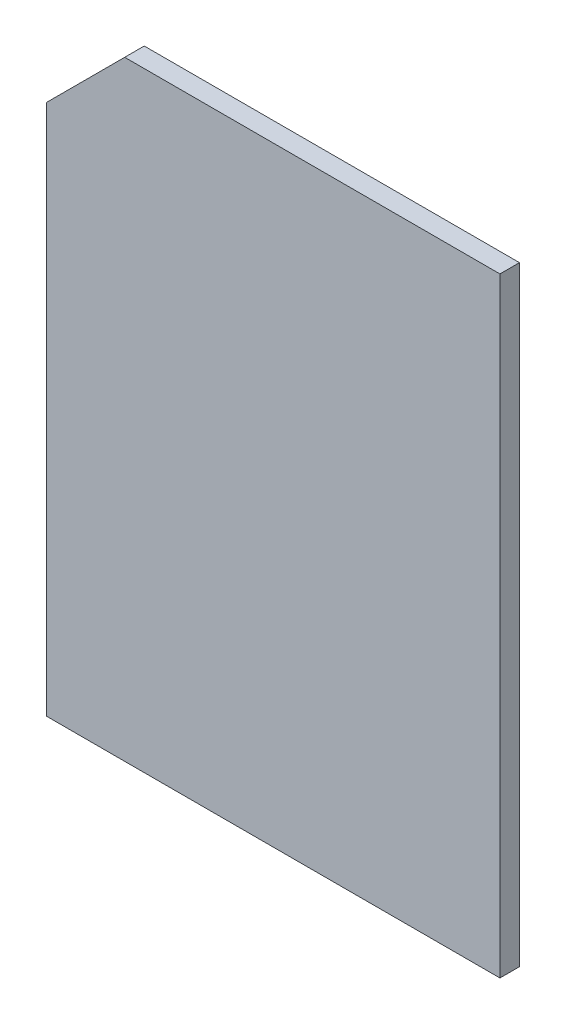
ISO-10303-21;
HEADER;
FILE_DESCRIPTION(('STEP AP214'),'2;1');
FILE_NAME('part.step','',(''),(''),'','','');
FILE_SCHEMA(('AUTOMOTIVE_DESIGN { 1 0 10303 214 1 1 1 1 }'));
ENDSEC;
DATA;
#1=APPLICATION_CONTEXT('core data for automotive mechanical design processes');
#2=APPLICATION_PROTOCOL_DEFINITION('international standard','automotive_design',2000,#1);
#3=PRODUCT_CONTEXT('',#1,'mechanical');
#4=PRODUCT('Part','Part','',(#3));
#5=PRODUCT_RELATED_PRODUCT_CATEGORY('part','',(#4));
#6=PRODUCT_DEFINITION_FORMATION('','',#4);
#7=PRODUCT_DEFINITION_CONTEXT('part definition',#1,'design');
#8=PRODUCT_DEFINITION('design','',#6,#7);
#9=PRODUCT_DEFINITION_SHAPE('','',#8);
#10=(LENGTH_UNIT() NAMED_UNIT(*) SI_UNIT(.MILLI.,.METRE.));
#11=(NAMED_UNIT(*) PLANE_ANGLE_UNIT() SI_UNIT($,.RADIAN.));
#12=(NAMED_UNIT(*) SI_UNIT($,.STERADIAN.) SOLID_ANGLE_UNIT());
#13=UNCERTAINTY_MEASURE_WITH_UNIT(LENGTH_MEASURE(1.E-05),#10,'distance_accuracy_value','');
#14=(GEOMETRIC_REPRESENTATION_CONTEXT(3) GLOBAL_UNCERTAINTY_ASSIGNED_CONTEXT((#13)) GLOBAL_UNIT_ASSIGNED_CONTEXT((#10,
#11,#12)) REPRESENTATION_CONTEXT('',''));
#15=CARTESIAN_POINT('',(0.,0.,0.));
#16=DIRECTION('',(0.,0.,1.));
#17=DIRECTION('',(1.,0.,0.));
#18=AXIS2_PLACEMENT_3D('',#15,#16,#17);
#19=CARTESIAN_POINT('',(0.,0.,1.5875));
#20=DIRECTION('',(-1.,0.,0.));
#21=DIRECTION('',(0.,0.,1.));
#22=AXIS2_PLACEMENT_3D('',#19,#20,#21);
#23=PLANE('',#22);
#24=DIRECTION('',(0.,1.,0.));
#25=VECTOR('',#24,1.);
#26=CARTESIAN_POINT('',(0.,0.,0.));
#27=LINE('',#26,#25);
#28=CARTESIAN_POINT('',(0.,0.,0.));
#29=VERTEX_POINT('',#28);
#30=CARTESIAN_POINT('',(0.,49.53,0.));
#31=VERTEX_POINT('',#30);
#32=EDGE_CURVE('E107',#29,#31,#27,.T.);
#33=ORIENTED_EDGE('',*,*,#32,.T.);
#34=DIRECTION('',(0.,0.,-1.));
#35=VECTOR('',#34,1.);
#36=CARTESIAN_POINT('',(0.,49.53,1.5875));
#37=LINE('',#36,#35);
#38=CARTESIAN_POINT('',(0.,49.53,1.5875));
#39=VERTEX_POINT('',#38);
#40=EDGE_CURVE('E11',#39,#31,#37,.T.);
#41=ORIENTED_EDGE('',*,*,#40,.F.);
#42=DIRECTION('',(0.,1.,0.));
#43=VECTOR('',#42,1.);
#44=CARTESIAN_POINT('',(0.,0.,1.5875));
#45=LINE('',#44,#43);
#46=CARTESIAN_POINT('',(0.,0.,1.5875));
#47=VERTEX_POINT('',#46);
#48=EDGE_CURVE('E115',#47,#39,#45,.T.);
#49=ORIENTED_EDGE('',*,*,#48,.F.);
#50=DIRECTION('',(0.,0.,-1.));
#51=VECTOR('',#50,1.);
#52=CARTESIAN_POINT('',(0.,0.,1.5875));
#53=LINE('',#52,#51);
#54=EDGE_CURVE('E103',#47,#29,#53,.T.);
#55=ORIENTED_EDGE('',*,*,#54,.T.);
#56=EDGE_LOOP('',(#33,#41,#49,#55));
#57=FACE_BOUND('',#56,.T.);
#58=ADVANCED_FACE('F33',(#57),#23,.F.);
#59=CARTESIAN_POINT('',(0.,49.53,1.5875));
#60=DIRECTION('',(0.,-1.,0.));
#61=DIRECTION('',(1.,0.,0.));
#62=AXIS2_PLACEMENT_3D('',#59,#60,#61);
#63=PLANE('',#62);
#64=DIRECTION('',(-1.,0.,0.));
#65=VECTOR('',#64,1.);
#66=CARTESIAN_POINT('',(0.,49.53,0.));
#67=LINE('',#66,#65);
#68=CARTESIAN_POINT('',(-30.48,49.53,0.));
#69=VERTEX_POINT('',#68);
#70=EDGE_CURVE('E110',#31,#69,#67,.T.);
#71=ORIENTED_EDGE('',*,*,#70,.T.);
#72=DIRECTION('',(0.,0.,-1.));
#73=VECTOR('',#72,1.);
#74=CARTESIAN_POINT('',(-30.48,49.53,1.5875));
#75=LINE('',#74,#73);
#76=CARTESIAN_POINT('',(-30.48,49.53,1.5875));
#77=VERTEX_POINT('',#76);
#78=EDGE_CURVE('E41',#77,#69,#75,.T.);
#79=ORIENTED_EDGE('',*,*,#78,.F.);
#80=DIRECTION('',(-1.,0.,0.));
#81=VECTOR('',#80,1.);
#82=CARTESIAN_POINT('',(0.,49.53,1.5875));
#83=LINE('',#82,#81);
#84=EDGE_CURVE('E83',#39,#77,#83,.T.);
#85=ORIENTED_EDGE('',*,*,#84,.F.);
#86=ORIENTED_EDGE('',*,*,#40,.T.);
#87=EDGE_LOOP('',(#71,#79,#85,#86));
#88=FACE_BOUND('',#87,.T.);
#89=ADVANCED_FACE('F134',(#88),#63,.F.);
#90=CARTESIAN_POINT('',(-30.48,49.53,1.5875));
#91=DIRECTION('',(0.707106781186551,-0.707106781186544,0.));
#92=DIRECTION('',(0.707106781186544,0.707106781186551,0.));
#93=AXIS2_PLACEMENT_3D('',#90,#91,#92);
#94=PLANE('',#93);
#95=DIRECTION('',(-0.707106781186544,-0.707106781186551,0.));
#96=VECTOR('',#95,1.);
#97=CARTESIAN_POINT('',(-30.48,49.53,0.));
#98=LINE('',#97,#96);
#99=CARTESIAN_POINT('',(-36.83,43.1799999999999,0.));
#100=VERTEX_POINT('',#99);
#101=EDGE_CURVE('E98',#69,#100,#98,.T.);
#102=ORIENTED_EDGE('',*,*,#101,.T.);
#103=DIRECTION('',(0.,0.,-1.));
#104=VECTOR('',#103,1.);
#105=CARTESIAN_POINT('',(-36.83,43.1799999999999,1.5875));
#106=LINE('',#105,#104);
#107=CARTESIAN_POINT('',(-36.83,43.1799999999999,1.5875));
#108=VERTEX_POINT('',#107);
#109=EDGE_CURVE('E95',#108,#100,#106,.T.);
#110=ORIENTED_EDGE('',*,*,#109,.F.);
#111=DIRECTION('',(-0.707106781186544,-0.707106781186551,0.));
#112=VECTOR('',#111,1.);
#113=CARTESIAN_POINT('',(-30.48,49.53,1.5875));
#114=LINE('',#113,#112);
#115=EDGE_CURVE('E87',#77,#108,#114,.T.);
#116=ORIENTED_EDGE('',*,*,#115,.F.);
#117=ORIENTED_EDGE('',*,*,#78,.T.);
#118=EDGE_LOOP('',(#102,#110,#116,#117));
#119=FACE_BOUND('',#118,.T.);
#120=ADVANCED_FACE('F96',(#119),#94,.F.);
#121=CARTESIAN_POINT('',(-36.83,0.,1.5875));
#122=DIRECTION('',(1.,0.,0.));
#123=DIRECTION('',(0.,0.,-1.));
#124=AXIS2_PLACEMENT_3D('',#121,#122,#123);
#125=PLANE('',#124);
#126=DIRECTION('',(0.,-1.,0.));
#127=VECTOR('',#126,1.);
#128=CARTESIAN_POINT('',(-36.83,0.,0.));
#129=LINE('',#128,#127);
#130=CARTESIAN_POINT('',(-36.83,0.,0.));
#131=VERTEX_POINT('',#130);
#132=EDGE_CURVE('E69',#100,#131,#129,.T.);
#133=ORIENTED_EDGE('',*,*,#132,.T.);
#134=DIRECTION('',(0.,0.,-1.));
#135=VECTOR('',#134,1.);
#136=CARTESIAN_POINT('',(-36.83,0.,1.5875));
#137=LINE('',#136,#135);
#138=CARTESIAN_POINT('',(-36.83,0.,1.5875));
#139=VERTEX_POINT('',#138);
#140=EDGE_CURVE('E99',#139,#131,#137,.T.);
#141=ORIENTED_EDGE('',*,*,#140,.F.);
#142=DIRECTION('',(0.,-1.,0.));
#143=VECTOR('',#142,1.);
#144=CARTESIAN_POINT('',(-36.83,0.,1.5875));
#145=LINE('',#144,#143);
#146=EDGE_CURVE('E91',#108,#139,#145,.T.);
#147=ORIENTED_EDGE('',*,*,#146,.F.);
#148=ORIENTED_EDGE('',*,*,#109,.T.);
#149=EDGE_LOOP('',(#133,#141,#147,#148));
#150=FACE_BOUND('',#149,.T.);
#151=ADVANCED_FACE('F101',(#150),#125,.F.);
#152=CARTESIAN_POINT('',(0.,0.,1.5875));
#153=DIRECTION('',(0.,1.,0.));
#154=DIRECTION('',(-1.,0.,0.));
#155=AXIS2_PLACEMENT_3D('',#152,#153,#154);
#156=PLANE('',#155);
#157=DIRECTION('',(1.,0.,0.));
#158=VECTOR('',#157,1.);
#159=CARTESIAN_POINT('',(0.,0.,0.));
#160=LINE('',#159,#158);
#161=EDGE_CURVE('E75',#131,#29,#160,.T.);
#162=ORIENTED_EDGE('',*,*,#161,.T.);
#163=ORIENTED_EDGE('',*,*,#54,.F.);
#164=DIRECTION('',(1.,0.,0.));
#165=VECTOR('',#164,1.);
#166=CARTESIAN_POINT('',(0.,0.,1.5875));
#167=LINE('',#166,#165);
#168=EDGE_CURVE('E49',#139,#47,#167,.T.);
#169=ORIENTED_EDGE('',*,*,#168,.F.);
#170=ORIENTED_EDGE('',*,*,#140,.T.);
#171=EDGE_LOOP('',(#162,#163,#169,#170));
#172=FACE_BOUND('',#171,.T.);
#173=ADVANCED_FACE('F123',(#172),#156,.F.);
#174=CARTESIAN_POINT('',(0.,0.,1.5875));
#175=DIRECTION('',(0.,0.,1.));
#176=DIRECTION('',(1.,0.,0.));
#177=AXIS2_PLACEMENT_3D('',#174,#175,#176);
#178=PLANE('',#177);
#179=ORIENTED_EDGE('',*,*,#48,.T.);
#180=ORIENTED_EDGE('',*,*,#84,.T.);
#181=ORIENTED_EDGE('',*,*,#115,.T.);
#182=ORIENTED_EDGE('',*,*,#146,.T.);
#183=ORIENTED_EDGE('',*,*,#168,.T.);
#184=EDGE_LOOP('',(#179,#180,#181,#182,#183));
#185=FACE_BOUND('',#184,.T.);
#186=ADVANCED_FACE('F89',(#185),#178,.T.);
#187=CARTESIAN_POINT('',(0.,0.,0.));
#188=DIRECTION('',(0.,0.,1.));
#189=DIRECTION('',(1.,0.,0.));
#190=AXIS2_PLACEMENT_3D('',#187,#188,#189);
#191=PLANE('',#190);
#192=ORIENTED_EDGE('',*,*,#32,.F.);
#193=ORIENTED_EDGE('',*,*,#161,.F.);
#194=ORIENTED_EDGE('',*,*,#132,.F.);
#195=ORIENTED_EDGE('',*,*,#101,.F.);
#196=ORIENTED_EDGE('',*,*,#70,.F.);
#197=EDGE_LOOP('',(#192,#193,#194,#195,#196));
#198=FACE_BOUND('',#197,.T.);
#199=ADVANCED_FACE('F119',(#198),#191,.F.);
#200=CLOSED_SHELL('',(#58,#89,#120,#151,#173,#186,#199));
#201=MANIFOLD_SOLID_BREP('B2',#200);
#202=ADVANCED_BREP_SHAPE_REPRESENTATION('',(#18,#201),#14);
#203=SHAPE_DEFINITION_REPRESENTATION(#9,#202);
ENDSEC;
END-ISO-10303-21;
